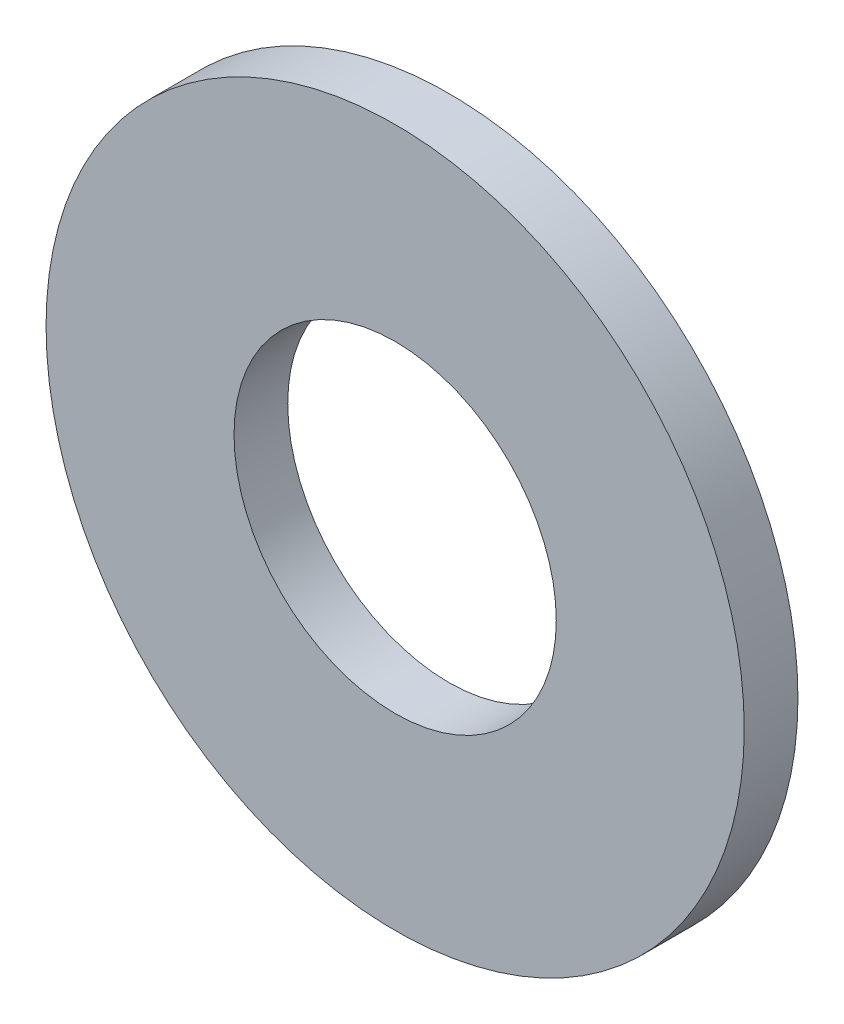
ISO-10303-21;
HEADER;
FILE_DESCRIPTION(('STEP AP214'),'2;1');
FILE_NAME('part.step','',(''),(''),'','','');
FILE_SCHEMA(('AUTOMOTIVE_DESIGN { 1 0 10303 214 1 1 1 1 }'));
ENDSEC;
DATA;
#1=APPLICATION_CONTEXT('core data for automotive mechanical design processes');
#2=APPLICATION_PROTOCOL_DEFINITION('international standard','automotive_design',2000,#1);
#3=PRODUCT_CONTEXT('',#1,'mechanical');
#4=PRODUCT('Part','Part','',(#3));
#5=PRODUCT_RELATED_PRODUCT_CATEGORY('part','',(#4));
#6=PRODUCT_DEFINITION_FORMATION('','',#4);
#7=PRODUCT_DEFINITION_CONTEXT('part definition',#1,'design');
#8=PRODUCT_DEFINITION('design','',#6,#7);
#9=PRODUCT_DEFINITION_SHAPE('','',#8);
#10=(LENGTH_UNIT() NAMED_UNIT(*) SI_UNIT(.MILLI.,.METRE.));
#11=(NAMED_UNIT(*) PLANE_ANGLE_UNIT() SI_UNIT($,.RADIAN.));
#12=(NAMED_UNIT(*) SI_UNIT($,.STERADIAN.) SOLID_ANGLE_UNIT());
#13=UNCERTAINTY_MEASURE_WITH_UNIT(LENGTH_MEASURE(1.E-05),#10,'distance_accuracy_value','');
#14=(GEOMETRIC_REPRESENTATION_CONTEXT(3) GLOBAL_UNCERTAINTY_ASSIGNED_CONTEXT((#13)) GLOBAL_UNIT_ASSIGNED_CONTEXT((#10,
#11,#12)) REPRESENTATION_CONTEXT('',''));
#15=CARTESIAN_POINT('',(0.,0.,0.));
#16=DIRECTION('',(0.,0.,1.));
#17=DIRECTION('',(1.,0.,0.));
#18=AXIS2_PLACEMENT_3D('',#15,#16,#17);
#19=CARTESIAN_POINT('',(0.,0.,0.5));
#20=DIRECTION('',(0.,0.,1.));
#21=DIRECTION('',(1.,0.,0.));
#22=AXIS2_PLACEMENT_3D('',#19,#20,#21);
#23=PLANE('',#22);
#24=CARTESIAN_POINT('',(0.,0.,0.5));
#25=DIRECTION('',(0.,0.,1.));
#26=DIRECTION('',(1.,0.,0.));
#27=AXIS2_PLACEMENT_3D('',#24,#25,#26);
#28=CIRCLE('',#27,3.25);
#29=CARTESIAN_POINT('',(3.25,0.,0.5));
#30=VERTEX_POINT('',#29);
#31=EDGE_CURVE('E10',#30,#30,#28,.T.);
#32=ORIENTED_EDGE('',*,*,#31,.T.);
#33=EDGE_LOOP('',(#32));
#34=FACE_BOUND('',#33,.T.);
#35=CARTESIAN_POINT('',(0.,0.,0.5));
#36=DIRECTION('',(0.,0.,1.));
#37=DIRECTION('',(1.,0.,0.));
#38=AXIS2_PLACEMENT_3D('',#35,#36,#37);
#39=CIRCLE('',#38,1.5);
#40=CARTESIAN_POINT('',(1.5,0.,0.5));
#41=VERTEX_POINT('',#40);
#42=EDGE_CURVE('E35',#41,#41,#39,.T.);
#43=ORIENTED_EDGE('',*,*,#42,.F.);
#44=EDGE_LOOP('',(#43));
#45=FACE_BOUND('',#44,.T.);
#46=ADVANCED_FACE('F24',(#34,#45),#23,.T.);
#47=CARTESIAN_POINT('',(0.,0.,0.));
#48=DIRECTION('',(0.,0.,1.));
#49=DIRECTION('',(1.,0.,0.));
#50=AXIS2_PLACEMENT_3D('',#47,#48,#49);
#51=PLANE('',#50);
#52=CARTESIAN_POINT('',(0.,0.,0.));
#53=DIRECTION('',(0.,0.,1.));
#54=DIRECTION('',(1.,0.,0.));
#55=AXIS2_PLACEMENT_3D('',#52,#53,#54);
#56=CIRCLE('',#55,3.25);
#57=CARTESIAN_POINT('',(3.25,0.,0.));
#58=VERTEX_POINT('',#57);
#59=EDGE_CURVE('E31',#58,#58,#56,.T.);
#60=ORIENTED_EDGE('',*,*,#59,.F.);
#61=EDGE_LOOP('',(#60));
#62=FACE_BOUND('',#61,.T.);
#63=CARTESIAN_POINT('',(0.,0.,0.));
#64=DIRECTION('',(0.,0.,1.));
#65=DIRECTION('',(1.,0.,0.));
#66=AXIS2_PLACEMENT_3D('',#63,#64,#65);
#67=CIRCLE('',#66,1.5);
#68=CARTESIAN_POINT('',(1.5,0.,0.));
#69=VERTEX_POINT('',#68);
#70=EDGE_CURVE('E39',#69,#69,#67,.T.);
#71=ORIENTED_EDGE('',*,*,#70,.T.);
#72=EDGE_LOOP('',(#71));
#73=FACE_BOUND('',#72,.T.);
#74=ADVANCED_FACE('F45',(#62,#73),#51,.F.);
#75=CARTESIAN_POINT('',(0.,0.,0.5));
#76=DIRECTION('',(0.,0.,-1.));
#77=DIRECTION('',(-1.,0.,0.));
#78=AXIS2_PLACEMENT_3D('',#75,#76,#77);
#79=CYLINDRICAL_SURFACE('',#78,3.25);
#80=ORIENTED_EDGE('',*,*,#31,.F.);
#81=EDGE_LOOP('',(#80));
#82=FACE_BOUND('',#81,.T.);
#83=ORIENTED_EDGE('',*,*,#59,.T.);
#84=EDGE_LOOP('',(#83));
#85=FACE_BOUND('',#84,.T.);
#86=ADVANCED_FACE('F26',(#82,#85),#79,.T.);
#87=CARTESIAN_POINT('',(0.,0.,0.5));
#88=DIRECTION('',(0.,0.,-1.));
#89=DIRECTION('',(-1.,0.,0.));
#90=AXIS2_PLACEMENT_3D('',#87,#88,#89);
#91=CYLINDRICAL_SURFACE('',#90,1.5);
#92=ORIENTED_EDGE('',*,*,#42,.T.);
#93=EDGE_LOOP('',(#92));
#94=FACE_BOUND('',#93,.T.);
#95=ORIENTED_EDGE('',*,*,#70,.F.);
#96=EDGE_LOOP('',(#95));
#97=FACE_BOUND('',#96,.T.);
#98=ADVANCED_FACE('F47',(#94,#97),#91,.F.);
#99=CLOSED_SHELL('',(#46,#74,#86,#98));
#100=MANIFOLD_SOLID_BREP('B2',#99);
#101=ADVANCED_BREP_SHAPE_REPRESENTATION('',(#18,#100),#14);
#102=SHAPE_DEFINITION_REPRESENTATION(#9,#101);
ENDSEC;
END-ISO-10303-21;
